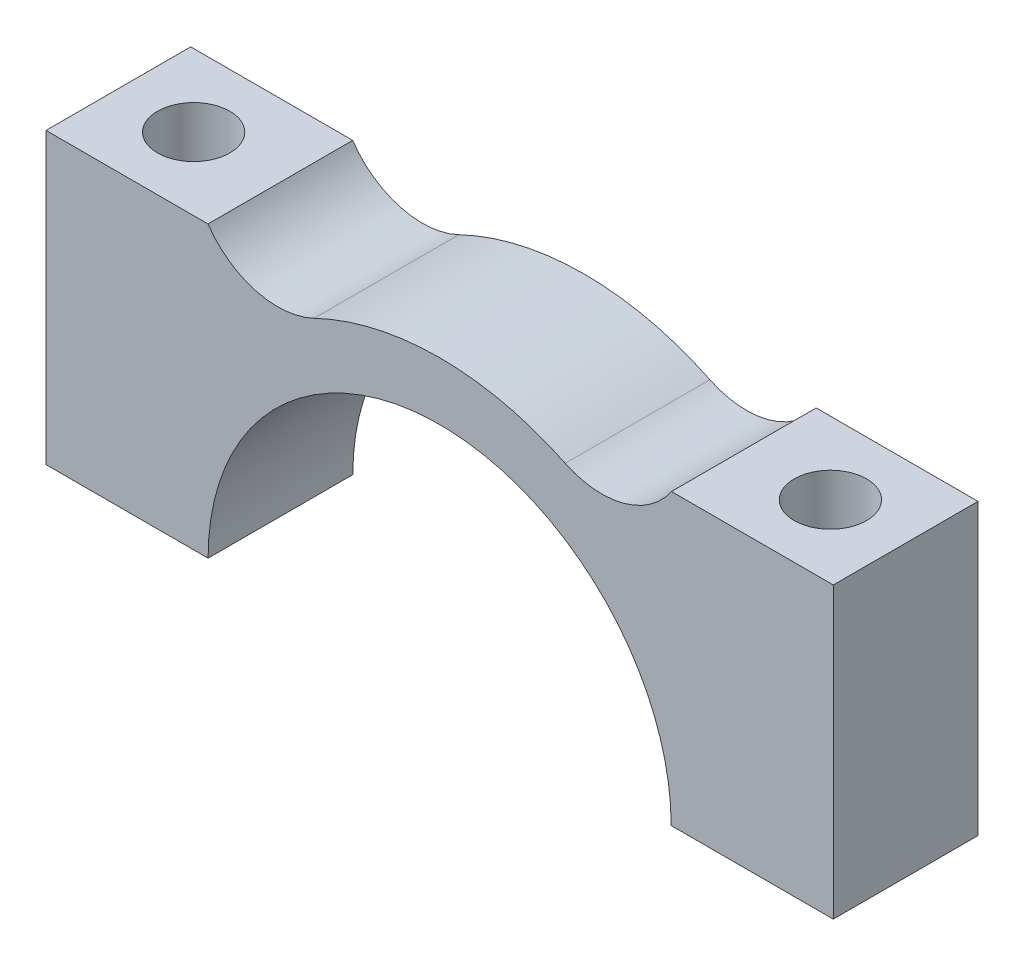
ISO-10303-21;
HEADER;
FILE_DESCRIPTION(('STEP AP214'),'2;1');
FILE_NAME('part.step','',(''),(''),'','','');
FILE_SCHEMA(('AUTOMOTIVE_DESIGN { 1 0 10303 214 1 1 1 1 }'));
ENDSEC;
DATA;
#1=APPLICATION_CONTEXT('core data for automotive mechanical design processes');
#2=APPLICATION_PROTOCOL_DEFINITION('international standard','automotive_design',2000,#1);
#3=PRODUCT_CONTEXT('',#1,'mechanical');
#4=PRODUCT('Part','Part','',(#3));
#5=PRODUCT_RELATED_PRODUCT_CATEGORY('part','',(#4));
#6=PRODUCT_DEFINITION_FORMATION('','',#4);
#7=PRODUCT_DEFINITION_CONTEXT('part definition',#1,'design');
#8=PRODUCT_DEFINITION('design','',#6,#7);
#9=PRODUCT_DEFINITION_SHAPE('','',#8);
#10=(LENGTH_UNIT() NAMED_UNIT(*) SI_UNIT(.MILLI.,.METRE.));
#11=(NAMED_UNIT(*) PLANE_ANGLE_UNIT() SI_UNIT($,.RADIAN.));
#12=(NAMED_UNIT(*) SI_UNIT($,.STERADIAN.) SOLID_ANGLE_UNIT());
#13=UNCERTAINTY_MEASURE_WITH_UNIT(LENGTH_MEASURE(1.E-05),#10,'distance_accuracy_value','');
#14=(GEOMETRIC_REPRESENTATION_CONTEXT(3) GLOBAL_UNCERTAINTY_ASSIGNED_CONTEXT((#13)) GLOBAL_UNIT_ASSIGNED_CONTEXT((#10,
#11,#12)) REPRESENTATION_CONTEXT('',''));
#15=CARTESIAN_POINT('',(0.,0.,0.));
#16=DIRECTION('',(0.,0.,1.));
#17=DIRECTION('',(1.,0.,0.));
#18=AXIS2_PLACEMENT_3D('',#15,#16,#17);
#19=CARTESIAN_POINT('',(0.,0.,5.));
#20=DIRECTION('',(0.,-1.,0.));
#21=DIRECTION('',(1.,0.,0.));
#22=AXIS2_PLACEMENT_3D('',#19,#20,#21);
#23=PLANE('',#22);
#24=CARTESIAN_POINT('',(-10.9989308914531,0.,2.49999999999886));
#25=DIRECTION('',(0.,1.,0.));
#26=DIRECTION('',(0.,0.,1.));
#27=AXIS2_PLACEMENT_3D('',#24,#25,#26);
#28=CIRCLE('',#27,1.25);
#29=CARTESIAN_POINT('',(-10.9989308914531,0.,3.74999999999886));
#30=VERTEX_POINT('',#29);
#31=EDGE_CURVE('E143',#30,#30,#28,.T.);
#32=ORIENTED_EDGE('',*,*,#31,.T.);
#33=EDGE_LOOP('',(#32));
#34=FACE_BOUND('',#33,.T.);
#35=DIRECTION('',(-1.,0.,0.));
#36=VECTOR('',#35,1.);
#37=CARTESIAN_POINT('',(0.,0.,0.));
#38=LINE('',#37,#36);
#39=CARTESIAN_POINT('',(-8.,0.,0.));
#40=VERTEX_POINT('',#39);
#41=CARTESIAN_POINT('',(-13.6,0.,0.));
#42=VERTEX_POINT('',#41);
#43=EDGE_CURVE('E140',#40,#42,#38,.T.);
#44=ORIENTED_EDGE('',*,*,#43,.F.);
#45=DIRECTION('',(0.,0.,-1.));
#46=VECTOR('',#45,1.);
#47=CARTESIAN_POINT('',(-8.,0.,5.));
#48=LINE('',#47,#46);
#49=CARTESIAN_POINT('',(-8.,0.,5.));
#50=VERTEX_POINT('',#49);
#51=EDGE_CURVE('E11',#50,#40,#48,.T.);
#52=ORIENTED_EDGE('',*,*,#51,.F.);
#53=DIRECTION('',(-1.,0.,0.));
#54=VECTOR('',#53,1.);
#55=CARTESIAN_POINT('',(0.,0.,5.));
#56=LINE('',#55,#54);
#57=CARTESIAN_POINT('',(-13.6,0.,5.));
#58=VERTEX_POINT('',#57);
#59=EDGE_CURVE('E165',#50,#58,#56,.T.);
#60=ORIENTED_EDGE('',*,*,#59,.T.);
#61=DIRECTION('',(0.,0.,-1.));
#62=VECTOR('',#61,1.);
#63=CARTESIAN_POINT('',(-13.6,0.,5.));
#64=LINE('',#63,#62);
#65=EDGE_CURVE('E51',#58,#42,#64,.T.);
#66=ORIENTED_EDGE('',*,*,#65,.T.);
#67=EDGE_LOOP('',(#44,#52,#60,#66));
#68=FACE_BOUND('',#67,.T.);
#69=ADVANCED_FACE('F35',(#34,#68),#23,.T.);
#70=CARTESIAN_POINT('',(0.,0.,5.));
#71=DIRECTION('',(0.,0.,-1.));
#72=DIRECTION('',(-1.,0.,0.));
#73=AXIS2_PLACEMENT_3D('',#70,#71,#72);
#74=CYLINDRICAL_SURFACE('',#73,8.);
#75=CARTESIAN_POINT('',(0.,0.,0.));
#76=DIRECTION('',(0.,0.,1.));
#77=DIRECTION('',(1.,0.,0.));
#78=AXIS2_PLACEMENT_3D('',#75,#76,#77);
#79=CIRCLE('',#78,8.);
#80=CARTESIAN_POINT('',(8.,0.,0.));
#81=VERTEX_POINT('',#80);
#82=EDGE_CURVE('E142',#81,#40,#79,.T.);
#83=ORIENTED_EDGE('',*,*,#82,.F.);
#84=DIRECTION('',(0.,0.,-1.));
#85=VECTOR('',#84,1.);
#86=CARTESIAN_POINT('',(8.,0.,5.));
#87=LINE('',#86,#85);
#88=CARTESIAN_POINT('',(8.,0.,5.));
#89=VERTEX_POINT('',#88);
#90=EDGE_CURVE('E43',#89,#81,#87,.T.);
#91=ORIENTED_EDGE('',*,*,#90,.F.);
#92=CARTESIAN_POINT('',(0.,0.,5.));
#93=DIRECTION('',(0.,0.,1.));
#94=DIRECTION('',(1.,0.,0.));
#95=AXIS2_PLACEMENT_3D('',#92,#93,#94);
#96=CIRCLE('',#95,8.);
#97=EDGE_CURVE('E193',#89,#50,#96,.T.);
#98=ORIENTED_EDGE('',*,*,#97,.T.);
#99=ORIENTED_EDGE('',*,*,#51,.T.);
#100=EDGE_LOOP('',(#83,#91,#98,#99));
#101=FACE_BOUND('',#100,.T.);
#102=ADVANCED_FACE('F192',(#101),#74,.F.);
#103=CARTESIAN_POINT('',(0.,0.,5.));
#104=DIRECTION('',(0.,1.,0.));
#105=DIRECTION('',(0.,0.,1.));
#106=AXIS2_PLACEMENT_3D('',#103,#104,#105);
#107=PLANE('',#106);
#108=CARTESIAN_POINT('',(11.0010691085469,0.,2.49999999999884));
#109=DIRECTION('',(0.,1.,0.));
#110=DIRECTION('',(0.,0.,1.));
#111=AXIS2_PLACEMENT_3D('',#108,#109,#110);
#112=CIRCLE('',#111,1.25);
#113=CARTESIAN_POINT('',(11.0010691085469,0.,3.74999999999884));
#114=VERTEX_POINT('',#113);
#115=EDGE_CURVE('E216',#114,#114,#112,.T.);
#116=ORIENTED_EDGE('',*,*,#115,.T.);
#117=EDGE_LOOP('',(#116));
#118=FACE_BOUND('',#117,.T.);
#119=DIRECTION('',(1.,0.,0.));
#120=VECTOR('',#119,1.);
#121=CARTESIAN_POINT('',(0.,0.,0.));
#122=LINE('',#121,#120);
#123=CARTESIAN_POINT('',(13.6,0.,0.));
#124=VERTEX_POINT('',#123);
#125=EDGE_CURVE('E146',#81,#124,#122,.T.);
#126=ORIENTED_EDGE('',*,*,#125,.T.);
#127=DIRECTION('',(0.,0.,-1.));
#128=VECTOR('',#127,1.);
#129=CARTESIAN_POINT('',(13.6,0.,5.));
#130=LINE('',#129,#128);
#131=CARTESIAN_POINT('',(13.6,0.,5.));
#132=VERTEX_POINT('',#131);
#133=EDGE_CURVE('E176',#132,#124,#130,.T.);
#134=ORIENTED_EDGE('',*,*,#133,.F.);
#135=DIRECTION('',(1.,0.,0.));
#136=VECTOR('',#135,1.);
#137=CARTESIAN_POINT('',(0.,0.,5.));
#138=LINE('',#137,#136);
#139=EDGE_CURVE('E183',#89,#132,#138,.T.);
#140=ORIENTED_EDGE('',*,*,#139,.F.);
#141=ORIENTED_EDGE('',*,*,#90,.T.);
#142=EDGE_LOOP('',(#126,#134,#140,#141));
#143=FACE_BOUND('',#142,.T.);
#144=ADVANCED_FACE('F181',(#118,#143),#107,.F.);
#145=CARTESIAN_POINT('',(13.6,0.,5.));
#146=DIRECTION('',(-1.,0.,0.));
#147=DIRECTION('',(0.,0.,1.));
#148=AXIS2_PLACEMENT_3D('',#145,#146,#147);
#149=PLANE('',#148);
#150=DIRECTION('',(0.,1.,0.));
#151=VECTOR('',#150,1.);
#152=CARTESIAN_POINT('',(13.6,0.,0.));
#153=LINE('',#152,#151);
#154=CARTESIAN_POINT('',(13.6,10.,0.));
#155=VERTEX_POINT('',#154);
#156=EDGE_CURVE('E148',#124,#155,#153,.T.);
#157=ORIENTED_EDGE('',*,*,#156,.T.);
#158=DIRECTION('',(0.,0.,-1.));
#159=VECTOR('',#158,1.);
#160=CARTESIAN_POINT('',(13.6,10.,5.));
#161=LINE('',#160,#159);
#162=CARTESIAN_POINT('',(13.6,10.,5.));
#163=VERTEX_POINT('',#162);
#164=EDGE_CURVE('E173',#163,#155,#161,.T.);
#165=ORIENTED_EDGE('',*,*,#164,.F.);
#166=DIRECTION('',(0.,1.,0.));
#167=VECTOR('',#166,1.);
#168=CARTESIAN_POINT('',(13.6,0.,5.));
#169=LINE('',#168,#167);
#170=EDGE_CURVE('E225',#132,#163,#169,.T.);
#171=ORIENTED_EDGE('',*,*,#170,.F.);
#172=ORIENTED_EDGE('',*,*,#133,.T.);
#173=EDGE_LOOP('',(#157,#165,#171,#172));
#174=FACE_BOUND('',#173,.T.);
#175=ADVANCED_FACE('F254',(#174),#149,.F.);
#176=CARTESIAN_POINT('',(0.,10.,5.));
#177=DIRECTION('',(0.,-1.,0.));
#178=DIRECTION('',(0.,0.,-1.));
#179=AXIS2_PLACEMENT_3D('',#176,#177,#178);
#180=PLANE('',#179);
#181=CARTESIAN_POINT('',(11.0010691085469,10.,2.49999999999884));
#182=DIRECTION('',(0.,1.,0.));
#183=DIRECTION('',(0.,0.,1.));
#184=AXIS2_PLACEMENT_3D('',#181,#182,#183);
#185=CIRCLE('',#184,1.25);
#186=CARTESIAN_POINT('',(11.0010691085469,10.,3.74999999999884));
#187=VERTEX_POINT('',#186);
#188=EDGE_CURVE('E219',#187,#187,#185,.T.);
#189=ORIENTED_EDGE('',*,*,#188,.F.);
#190=EDGE_LOOP('',(#189));
#191=FACE_BOUND('',#190,.T.);
#192=DIRECTION('',(-1.,0.,0.));
#193=VECTOR('',#192,1.);
#194=CARTESIAN_POINT('',(0.,10.,0.));
#195=LINE('',#194,#193);
#196=CARTESIAN_POINT('',(8.00887124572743,10.,0.));
#197=VERTEX_POINT('',#196);
#198=EDGE_CURVE('E150',#155,#197,#195,.T.);
#199=ORIENTED_EDGE('',*,*,#198,.T.);
#200=DIRECTION('',(0.,0.,-1.));
#201=VECTOR('',#200,1.);
#202=CARTESIAN_POINT('',(8.00887124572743,10.,5.));
#203=LINE('',#202,#201);
#204=CARTESIAN_POINT('',(8.00887124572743,10.,5.));
#205=VERTEX_POINT('',#204);
#206=EDGE_CURVE('E171',#205,#197,#203,.T.);
#207=ORIENTED_EDGE('',*,*,#206,.F.);
#208=DIRECTION('',(-1.,0.,0.));
#209=VECTOR('',#208,1.);
#210=CARTESIAN_POINT('',(0.,10.,5.));
#211=LINE('',#210,#209);
#212=EDGE_CURVE('E227',#163,#205,#211,.T.);
#213=ORIENTED_EDGE('',*,*,#212,.F.);
#214=ORIENTED_EDGE('',*,*,#164,.T.);
#215=EDGE_LOOP('',(#199,#207,#213,#214));
#216=FACE_BOUND('',#215,.T.);
#217=ADVANCED_FACE('F239',(#191,#216),#180,.F.);
#218=CARTESIAN_POINT('',(5.59999999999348,11.6315143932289,5.));
#219=DIRECTION('',(0.,0.,-1.));
#220=DIRECTION('',(-1.,0.,0.));
#221=AXIS2_PLACEMENT_3D('',#218,#219,#220);
#222=CYLINDRICAL_SURFACE('',#221,2.9093813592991);
#223=CARTESIAN_POINT('',(5.59999999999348,11.6315143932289,0.));
#224=DIRECTION('',(0.,0.,1.));
#225=DIRECTION('',(1.,0.,0.));
#226=AXIS2_PLACEMENT_3D('',#223,#224,#225);
#227=CIRCLE('',#226,2.9093813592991);
#228=CARTESIAN_POINT('',(4.33793056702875,9.01012532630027,0.));
#229=VERTEX_POINT('',#228);
#230=EDGE_CURVE('E153',#229,#197,#227,.T.);
#231=ORIENTED_EDGE('',*,*,#230,.F.);
#232=DIRECTION('',(0.,0.,-1.));
#233=VECTOR('',#232,1.);
#234=CARTESIAN_POINT('',(4.33793056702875,9.01012532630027,5.));
#235=LINE('',#234,#233);
#236=CARTESIAN_POINT('',(4.33793056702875,9.01012532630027,5.));
#237=VERTEX_POINT('',#236);
#238=EDGE_CURVE('E169',#237,#229,#235,.T.);
#239=ORIENTED_EDGE('',*,*,#238,.F.);
#240=CARTESIAN_POINT('',(5.59999999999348,11.6315143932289,5.));
#241=DIRECTION('',(0.,0.,1.));
#242=DIRECTION('',(1.,0.,0.));
#243=AXIS2_PLACEMENT_3D('',#240,#241,#242);
#244=CIRCLE('',#243,2.9093813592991);
#245=EDGE_CURVE('E229',#237,#205,#244,.T.);
#246=ORIENTED_EDGE('',*,*,#245,.T.);
#247=ORIENTED_EDGE('',*,*,#206,.T.);
#248=EDGE_LOOP('',(#231,#239,#246,#247));
#249=FACE_BOUND('',#248,.T.);
#250=ADVANCED_FACE('F233',(#249),#222,.F.);
#251=CARTESIAN_POINT('',(0.,0.,5.));
#252=DIRECTION('',(0.,0.,-1.));
#253=DIRECTION('',(-1.,0.,0.));
#254=AXIS2_PLACEMENT_3D('',#251,#252,#253);
#255=CYLINDRICAL_SURFACE('',#254,10.);
#256=CARTESIAN_POINT('',(0.,0.,0.));
#257=DIRECTION('',(0.,0.,1.));
#258=DIRECTION('',(1.,0.,0.));
#259=AXIS2_PLACEMENT_3D('',#256,#257,#258);
#260=CIRCLE('',#259,10.);
#261=CARTESIAN_POINT('',(-4.33579234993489,9.01115445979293,0.));
#262=VERTEX_POINT('',#261);
#263=EDGE_CURVE('E156',#229,#262,#260,.T.);
#264=ORIENTED_EDGE('',*,*,#263,.T.);
#265=DIRECTION('',(0.,0.,-1.));
#266=VECTOR('',#265,1.);
#267=CARTESIAN_POINT('',(-4.33579234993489,9.01115445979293,5.));
#268=LINE('',#267,#266);
#269=CARTESIAN_POINT('',(-4.33579234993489,9.01115445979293,5.));
#270=VERTEX_POINT('',#269);
#271=EDGE_CURVE('E122',#270,#262,#268,.T.);
#272=ORIENTED_EDGE('',*,*,#271,.F.);
#273=CARTESIAN_POINT('',(0.,0.,5.));
#274=DIRECTION('',(0.,0.,1.));
#275=DIRECTION('',(1.,0.,0.));
#276=AXIS2_PLACEMENT_3D('',#273,#274,#275);
#277=CIRCLE('',#276,10.);
#278=EDGE_CURVE('E131',#237,#270,#277,.T.);
#279=ORIENTED_EDGE('',*,*,#278,.F.);
#280=ORIENTED_EDGE('',*,*,#238,.T.);
#281=EDGE_LOOP('',(#264,#272,#279,#280));
#282=FACE_BOUND('',#281,.T.);
#283=ADVANCED_FACE('F242',(#282),#255,.T.);
#284=CARTESIAN_POINT('',(-5.59660045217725,11.6315143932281,5.));
#285=DIRECTION('',(0.,0.,-1.));
#286=DIRECTION('',(-1.,0.,0.));
#287=AXIS2_PLACEMENT_3D('',#284,#285,#286);
#288=CYLINDRICAL_SURFACE('',#287,2.90790702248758);
#289=CARTESIAN_POINT('',(-5.59660045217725,11.6315143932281,0.));
#290=DIRECTION('',(0.,0.,1.));
#291=DIRECTION('',(1.,0.,0.));
#292=AXIS2_PLACEMENT_3D('',#289,#290,#291);
#293=CIRCLE('',#292,2.90790702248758);
#294=CARTESIAN_POINT('',(-8.0036908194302,10.,0.));
#295=VERTEX_POINT('',#294);
#296=EDGE_CURVE('E118',#295,#262,#293,.T.);
#297=ORIENTED_EDGE('',*,*,#296,.F.);
#298=DIRECTION('',(0.,0.,-1.));
#299=VECTOR('',#298,1.);
#300=CARTESIAN_POINT('',(-8.0036908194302,10.,5.));
#301=LINE('',#300,#299);
#302=CARTESIAN_POINT('',(-8.0036908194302,10.,5.));
#303=VERTEX_POINT('',#302);
#304=EDGE_CURVE('E113',#303,#295,#301,.T.);
#305=ORIENTED_EDGE('',*,*,#304,.F.);
#306=CARTESIAN_POINT('',(-5.59660045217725,11.6315143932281,5.));
#307=DIRECTION('',(0.,0.,1.));
#308=DIRECTION('',(1.,0.,0.));
#309=AXIS2_PLACEMENT_3D('',#306,#307,#308);
#310=CIRCLE('',#309,2.90790702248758);
#311=EDGE_CURVE('E116',#303,#270,#310,.T.);
#312=ORIENTED_EDGE('',*,*,#311,.T.);
#313=ORIENTED_EDGE('',*,*,#271,.T.);
#314=EDGE_LOOP('',(#297,#305,#312,#313));
#315=FACE_BOUND('',#314,.T.);
#316=ADVANCED_FACE('F115',(#315),#288,.F.);
#317=CARTESIAN_POINT('',(0.,10.,5.));
#318=DIRECTION('',(0.,1.,0.));
#319=DIRECTION('',(0.,0.,1.));
#320=AXIS2_PLACEMENT_3D('',#317,#318,#319);
#321=PLANE('',#320);
#322=CARTESIAN_POINT('',(-10.9989308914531,10.,2.49999999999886));
#323=DIRECTION('',(0.,1.,0.));
#324=DIRECTION('',(0.,0.,1.));
#325=AXIS2_PLACEMENT_3D('',#322,#323,#324);
#326=CIRCLE('',#325,1.25);
#327=CARTESIAN_POINT('',(-10.9989308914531,10.,3.74999999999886));
#328=VERTEX_POINT('',#327);
#329=EDGE_CURVE('E213',#328,#328,#326,.T.);
#330=ORIENTED_EDGE('',*,*,#329,.F.);
#331=EDGE_LOOP('',(#330));
#332=FACE_BOUND('',#331,.T.);
#333=DIRECTION('',(1.,0.,0.));
#334=VECTOR('',#333,1.);
#335=CARTESIAN_POINT('',(0.,10.,0.));
#336=LINE('',#335,#334);
#337=CARTESIAN_POINT('',(-13.6,10.,0.));
#338=VERTEX_POINT('',#337);
#339=EDGE_CURVE('E160',#338,#295,#336,.T.);
#340=ORIENTED_EDGE('',*,*,#339,.F.);
#341=DIRECTION('',(0.,0.,-1.));
#342=VECTOR('',#341,1.);
#343=CARTESIAN_POINT('',(-13.6,10.,5.));
#344=LINE('',#343,#342);
#345=CARTESIAN_POINT('',(-13.6,10.,5.));
#346=VERTEX_POINT('',#345);
#347=EDGE_CURVE('E82',#346,#338,#344,.T.);
#348=ORIENTED_EDGE('',*,*,#347,.F.);
#349=DIRECTION('',(1.,0.,0.));
#350=VECTOR('',#349,1.);
#351=CARTESIAN_POINT('',(0.,10.,5.));
#352=LINE('',#351,#350);
#353=EDGE_CURVE('E128',#346,#303,#352,.T.);
#354=ORIENTED_EDGE('',*,*,#353,.T.);
#355=ORIENTED_EDGE('',*,*,#304,.T.);
#356=EDGE_LOOP('',(#340,#348,#354,#355));
#357=FACE_BOUND('',#356,.T.);
#358=ADVANCED_FACE('F134',(#332,#357),#321,.T.);
#359=CARTESIAN_POINT('',(-13.6,0.,5.));
#360=DIRECTION('',(-1.,0.,0.));
#361=DIRECTION('',(0.,0.,1.));
#362=AXIS2_PLACEMENT_3D('',#359,#360,#361);
#363=PLANE('',#362);
#364=DIRECTION('',(0.,1.,0.));
#365=VECTOR('',#364,1.);
#366=CARTESIAN_POINT('',(-13.6,0.,0.));
#367=LINE('',#366,#365);
#368=EDGE_CURVE('E162',#42,#338,#367,.T.);
#369=ORIENTED_EDGE('',*,*,#368,.F.);
#370=ORIENTED_EDGE('',*,*,#65,.F.);
#371=DIRECTION('',(0.,1.,0.));
#372=VECTOR('',#371,1.);
#373=CARTESIAN_POINT('',(-13.6,0.,5.));
#374=LINE('',#373,#372);
#375=EDGE_CURVE('E135',#58,#346,#374,.T.);
#376=ORIENTED_EDGE('',*,*,#375,.T.);
#377=ORIENTED_EDGE('',*,*,#347,.T.);
#378=EDGE_LOOP('',(#369,#370,#376,#377));
#379=FACE_BOUND('',#378,.T.);
#380=ADVANCED_FACE('F194',(#379),#363,.T.);
#381=CARTESIAN_POINT('',(0.,0.,5.));
#382=DIRECTION('',(0.,0.,1.));
#383=DIRECTION('',(1.,0.,0.));
#384=AXIS2_PLACEMENT_3D('',#381,#382,#383);
#385=PLANE('',#384);
#386=ORIENTED_EDGE('',*,*,#59,.F.);
#387=ORIENTED_EDGE('',*,*,#97,.F.);
#388=ORIENTED_EDGE('',*,*,#139,.T.);
#389=ORIENTED_EDGE('',*,*,#170,.T.);
#390=ORIENTED_EDGE('',*,*,#212,.T.);
#391=ORIENTED_EDGE('',*,*,#245,.F.);
#392=ORIENTED_EDGE('',*,*,#278,.T.);
#393=ORIENTED_EDGE('',*,*,#311,.F.);
#394=ORIENTED_EDGE('',*,*,#353,.F.);
#395=ORIENTED_EDGE('',*,*,#375,.F.);
#396=EDGE_LOOP('',(#386,#387,#388,#389,#390,#391,#392,#393,#394,#395));
#397=FACE_BOUND('',#396,.T.);
#398=ADVANCED_FACE('F126',(#397),#385,.T.);
#399=CARTESIAN_POINT('',(0.,0.,0.));
#400=DIRECTION('',(0.,0.,1.));
#401=DIRECTION('',(1.,0.,0.));
#402=AXIS2_PLACEMENT_3D('',#399,#400,#401);
#403=PLANE('',#402);
#404=ORIENTED_EDGE('',*,*,#43,.T.);
#405=ORIENTED_EDGE('',*,*,#368,.T.);
#406=ORIENTED_EDGE('',*,*,#339,.T.);
#407=ORIENTED_EDGE('',*,*,#296,.T.);
#408=ORIENTED_EDGE('',*,*,#263,.F.);
#409=ORIENTED_EDGE('',*,*,#230,.T.);
#410=ORIENTED_EDGE('',*,*,#198,.F.);
#411=ORIENTED_EDGE('',*,*,#156,.F.);
#412=ORIENTED_EDGE('',*,*,#125,.F.);
#413=ORIENTED_EDGE('',*,*,#82,.T.);
#414=EDGE_LOOP('',(#404,#405,#406,#407,#408,#409,#410,#411,#412,#413));
#415=FACE_BOUND('',#414,.T.);
#416=ADVANCED_FACE('F190',(#415),#403,.F.);
#417=CARTESIAN_POINT('',(-10.9989308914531,0.,2.49999999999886));
#418=DIRECTION('',(0.,1.,0.));
#419=DIRECTION('',(0.,0.,1.));
#420=AXIS2_PLACEMENT_3D('',#417,#418,#419);
#421=CYLINDRICAL_SURFACE('',#420,1.25);
#422=ORIENTED_EDGE('',*,*,#31,.F.);
#423=EDGE_LOOP('',(#422));
#424=FACE_BOUND('',#423,.T.);
#425=ORIENTED_EDGE('',*,*,#329,.T.);
#426=EDGE_LOOP('',(#425));
#427=FACE_BOUND('',#426,.T.);
#428=ADVANCED_FACE('F271',(#424,#427),#421,.F.);
#429=CARTESIAN_POINT('',(11.0010691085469,0.,2.49999999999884));
#430=DIRECTION('',(0.,1.,0.));
#431=DIRECTION('',(0.,0.,1.));
#432=AXIS2_PLACEMENT_3D('',#429,#430,#431);
#433=CYLINDRICAL_SURFACE('',#432,1.25);
#434=ORIENTED_EDGE('',*,*,#115,.F.);
#435=EDGE_LOOP('',(#434));
#436=FACE_BOUND('',#435,.T.);
#437=ORIENTED_EDGE('',*,*,#188,.T.);
#438=EDGE_LOOP('',(#437));
#439=FACE_BOUND('',#438,.T.);
#440=ADVANCED_FACE('F269',(#436,#439),#433,.F.);
#441=CLOSED_SHELL('',(#69,#102,#144,#175,#217,#250,#283,#316,#358,#380,#398,#416,#428,#440));
#442=MANIFOLD_SOLID_BREP('B2',#441);
#443=ADVANCED_BREP_SHAPE_REPRESENTATION('',(#18,#442),#14);
#444=SHAPE_DEFINITION_REPRESENTATION(#9,#443);
ENDSEC;
END-ISO-10303-21;
